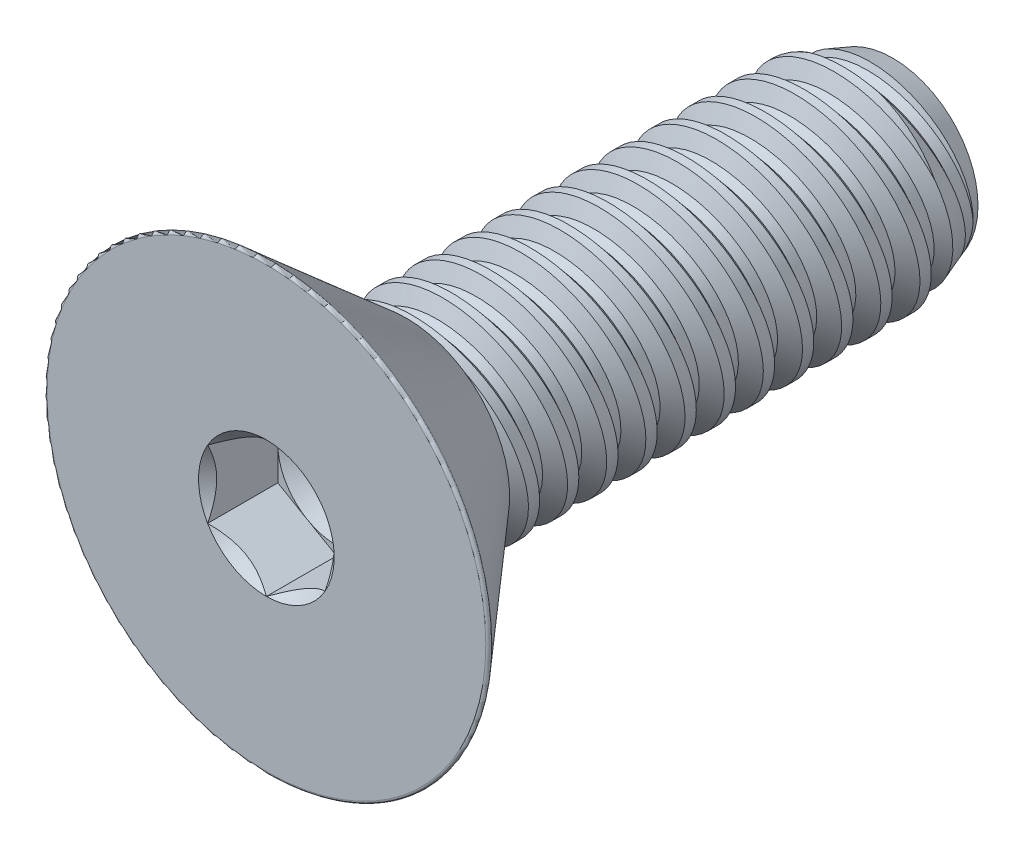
from build123d import *

# Parameters (mm, degrees)
SKETCH1_W          = 9.8552
SKETCH1_H          = 2.0828
LPATTERN1_COUNT    = 12
LPATTERN1_PITCH    = 0.79375
LPATTERN2_COUNT    = 2
LPATTERN2_PITCH    = 0.79375
SKETCH4_R          = 4.5593
EXTRUDE1_DEPTH     = 2.8448
FILLET1_R          = 0.0508
CUT_EXTRUDE1_DEPTH = 1.4224
SKETCH8_R          = 1.190625
CUT_EXTRUDE5_DEPTH = 0.474133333
CUT_EXTRUDE5_DRAFT = -60


with BuildPart() as part:
    # Sketch1 → Revolve1 (revolve)
    with BuildSketch(Plane(origin=(0, 0, 0), x_dir=(0, 0, -1), z_dir=(1, 0, 0)), mode=Mode.PRIVATE) as revolve1_sk:
        with Locations((4.9276, 1.0414)):
            Rectangle(SKETCH1_W, SKETCH1_H)
    revolve(revolve1_sk.sketch.rotate(Axis((0, 0, 0), (0, 0, 1)), 143.466023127), axis=Axis((0, 0, 0), (0, 0, 1)))

    # Sketch2 → Cut-Revolve1 (revolve, cut)
    with BuildSketch(Plane(origin=(0, 0, 0), x_dir=(0, 0, -1), z_dir=(1, 0, 0)), mode=Mode.PRIVATE) as cut_revolve1_sk:
        Polygon((0.097465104, 2.101371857), (0.779720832, 2.231374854), (0.61647657, 1.762908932), (0.421546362, 1.725765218), align=None)
    cut_revolve1 = revolve(cut_revolve1_sk.sketch.rotate(Axis((0, -0.162231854, 0), (0, 0.18718091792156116, -0.9823254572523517)), 180), axis=Axis((0, -0.162231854, 0), (0, 0.18718091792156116, -0.9823254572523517)), mode=Mode.SUBTRACT)

    # Sketch3 → Cut-Revolve2 (revolve, cut)
    with BuildSketch(Plane(origin=(0, 0, 0), x_dir=(0, 0, -1), z_dir=(1, 0, 0)), mode=Mode.PRIVATE) as cut_revolve2_sk:
        Polygon((9.8552, 1.725765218), (8.874255, 2.0828), (9.8552, 2.0828), align=None)
    revolve(cut_revolve2_sk.sketch.rotate(Axis((0, 0, -8.874255), (0, 0, 1)), 143.466023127), axis=Axis((0, 0, -8.874255), (0, 0, 1)), mode=Mode.SUBTRACT)

    # LPattern1: Cut-Revolve1 ×12
    with Locations(*[(0, 0, -i * LPATTERN1_PITCH) for i in range(1, LPATTERN1_COUNT)]):
        add(cut_revolve1, mode=Mode.SUBTRACT)

    # LPattern2: Cut-Revolve1 ×2
    with Locations(*[(0, 0, i * LPATTERN2_PITCH) for i in range(1, LPATTERN2_COUNT)]):
        add(cut_revolve1, mode=Mode.SUBTRACT)

    # Sketch4 → Extrude1 (add)
    with BuildSketch(Plane.XY):
        Circle(SKETCH4_R)
    extrude(amount=EXTRUDE1_DEPTH)

    # Sketch9 → Cut-Revolve3 (revolve, cut)
    with BuildSketch(Plane(origin=(0, 0, 0), x_dir=(0, 0, -1), z_dir=(1, 0, 0)), mode=Mode.PRIVATE) as cut_revolve3_sk:
        Polygon((-2.8448, 4.5593), (0, 2.086353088), (0, 4.5593), align=None)
    revolve(cut_revolve3_sk.sketch.rotate(Axis((0, 0, 0), (0, 0, 1)), 136.412456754), axis=Axis((0, 0, 0), (0, 0, 1)), mode=Mode.SUBTRACT)

    # Fillet1
    fillet1_edges = [part.edges().sort_by_distance(p)[0] for p in [
        (3.143464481, 3.302400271, 2.8448),
    ]]
    fillet(fillet1_edges, radius=FILLET1_R)

    # Sketch6 → Cut-Extrude1 (cut)
    with BuildSketch(Plane.XY.offset(2.8448)):
        Polygon((0, -1.374815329), (1.190625, -0.687407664), (1.190625, 0.687407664), (0, 1.374815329), (-1.190625, 0.687407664), (-1.190625, -0.687407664), align=None)
    extrude(amount=-CUT_EXTRUDE1_DEPTH, mode=Mode.SUBTRACT)

    # Cut-Extrude4 cone 1 section (on through the dimple's axis) → Cut-Extrude4 (revolve, cut)
    with BuildSketch(Plane(origin=(0, 0, 2.8448), x_dir=(0, -1, 0), z_dir=(1, 0, 0))):
        Polygon((0, 0), (1.374815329, 0), (0, 1.374815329), align=None)
    revolve(axis=Axis((0, 0, 2.8448), (0, 0, -1)), mode=Mode.SUBTRACT)


with BuildPart() as cut_extrude5_tool:
    # Sketch8 → Cut-Extrude5 (with draft: the straight prism first)
    with BuildSketch(Plane.XY.offset(1.4224)):
        Circle(SKETCH8_R)
    extrude(amount=-CUT_EXTRUDE5_DEPTH)
    # Cut-Extrude5: the draft: its side faces are tilted about the plane it starts from
    cut_extrude5_sides = [cut_extrude5_tool.faces().sort_by_distance(p)[0] for p in [
        (-1.190625, 0, 1.185333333),
    ]]
    draft(cut_extrude5_sides, Plane.XY.offset(1.4224), CUT_EXTRUDE5_DRAFT)


with BuildPart() as part_1:
    add(part.part)

    # Cut-Extrude5: cut by cut_extrude5_tool
    add(cut_extrude5_tool.part, mode=Mode.SUBTRACT)


solid = part_1.part
